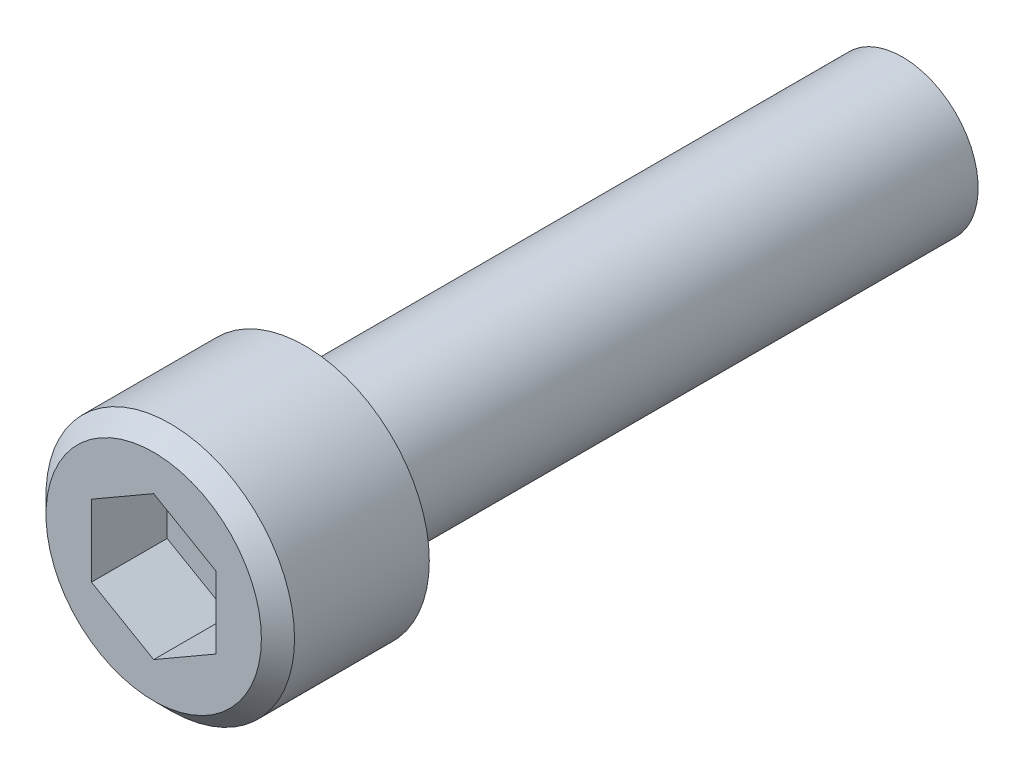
from build123d import *

# Parameters (mm, degrees)
SKETCH1_R     = 2.413
SHANK_DEPTH   = 19.05
SKETCH2_R     = 3.9624
CAP_DEPTH     = 4.826
FILLET1_R     = 0.3556
HEXCUT_DEPTH  = 2.413
CHAMFER1_SIZE = 0.52832


with BuildPart() as part:
    # Sketch1 → Shank (new body)
    with BuildSketch(Plane.XY):
        with Locations(Location((0, 0, 0), (0, 0, 180))):
            Circle(SKETCH1_R)
    extrude(amount=SHANK_DEPTH)

    # Sketch2 → Cap (add)
    with BuildSketch(Plane.XY.offset(19.05)):
        Circle(SKETCH2_R)
    extrude(amount=CAP_DEPTH)

    # Fillet1
    fillet1_edges = [part.edges().sort_by_distance(p)[0] for p in [
        (2.413, 0, 19.05),
    ]]
    fillet(fillet1_edges, radius=FILLET1_R)

    # Sketch3 → HexCut (cut)
    with BuildSketch(Plane(origin=(4.874850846, 0.925692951, 23.876), x_dir=(1, 0, 0), z_dir=(0, 0, 1))):
        Polygon((-4.874850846, 1.36566593), (-2.890475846, 0.219986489), (-2.890475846, -2.071372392), (-4.874850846, -3.217051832), (-6.859225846, -2.071372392), (-6.859225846, 0.219986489), align=None)
    extrude(amount=-HEXCUT_DEPTH, mode=Mode.SUBTRACT)

    # Chamfer1
    chamfer1_edges = [part.edges().sort_by_distance(p)[0] for p in [
        (-3.9624, 0, 23.876),
    ]]
    chamfer(chamfer1_edges, length=CHAMFER1_SIZE)


solid = part.part
